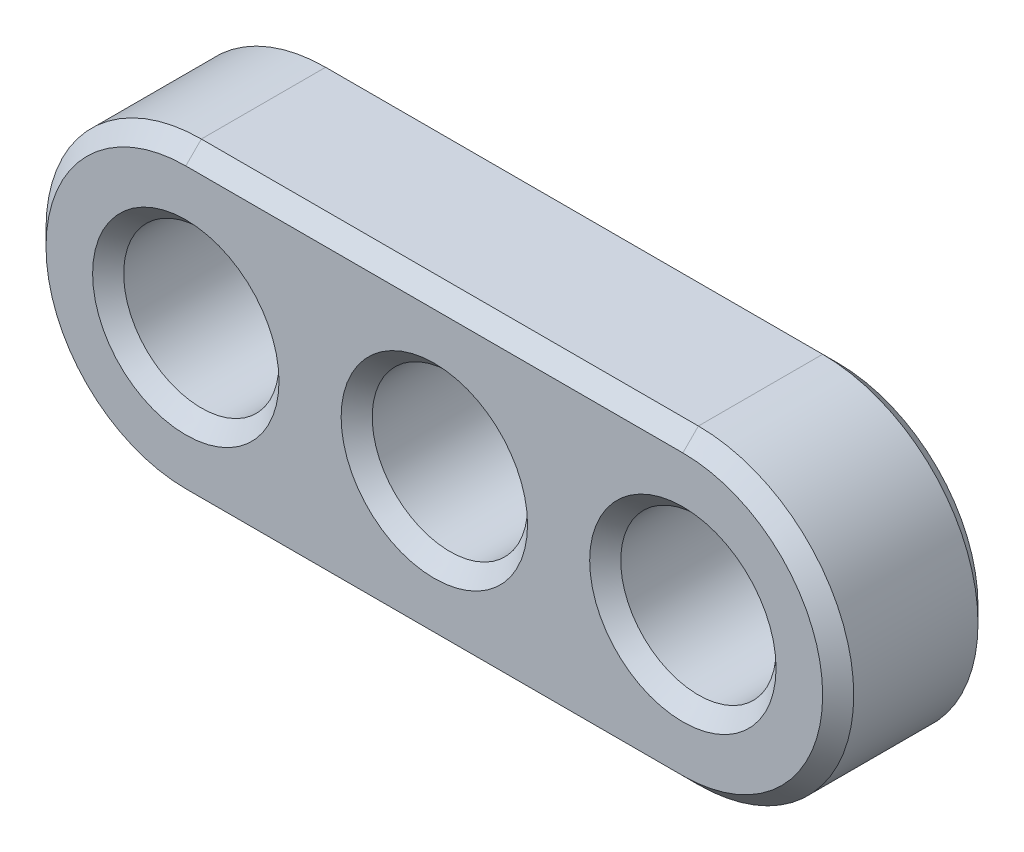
from build123d import *

# Parameters (mm, degrees)
ESQUISSE1_R        = 3.75
BOSS_EXTRU_1_DEPTH = 7.5
CHANFREIN1_SIZE    = 0.75


with BuildPart() as part:
    # Esquisse1 → Boss.-Extru.1 (new body)
    with BuildSketch(Plane.XY):
        with BuildLine():
            Line((12, -7.5), (-12, -7.5))
            ThreePointArc((-12, -7.5), (-19.5, 0), (-12, 7.5))
            Line((-12, 7.5), (12, 7.5))
            ThreePointArc((12, 7.5), (19.5, 0), (12, -7.5))
        make_face()
        with Locations((-12, 0)):
            Circle(ESQUISSE1_R, mode=Mode.SUBTRACT)
        Circle(ESQUISSE1_R, mode=Mode.SUBTRACT)
        with Locations((12, 0)):
            Circle(ESQUISSE1_R, mode=Mode.SUBTRACT)
    extrude(amount=BOSS_EXTRU_1_DEPTH)

    # Chanfrein1
    chanfrein1_edges = [part.edges().sort_by_distance(p)[0] for p in [
        (-19.5, 0, 7.5),
        (-15.75, 0, 0),
        (-15.75, 0, 7.5),
        (0, -7.5, 7.5),
        (-3.75, 0, 0),
        (-3.75, 0, 7.5),
        (8.25, 0, 0),
        (8.25, 0, 7.5),
        (19.5, 0, 7.5),
        (0, -7.5, 0),
        (-19.5, 0, 0),
        (0, 7.5, 0),
        (19.5, 0, 0),
        (0, 7.5, 7.5),
    ]]
    chamfer(chanfrein1_edges, length=CHANFREIN1_SIZE)


solid = part.part
